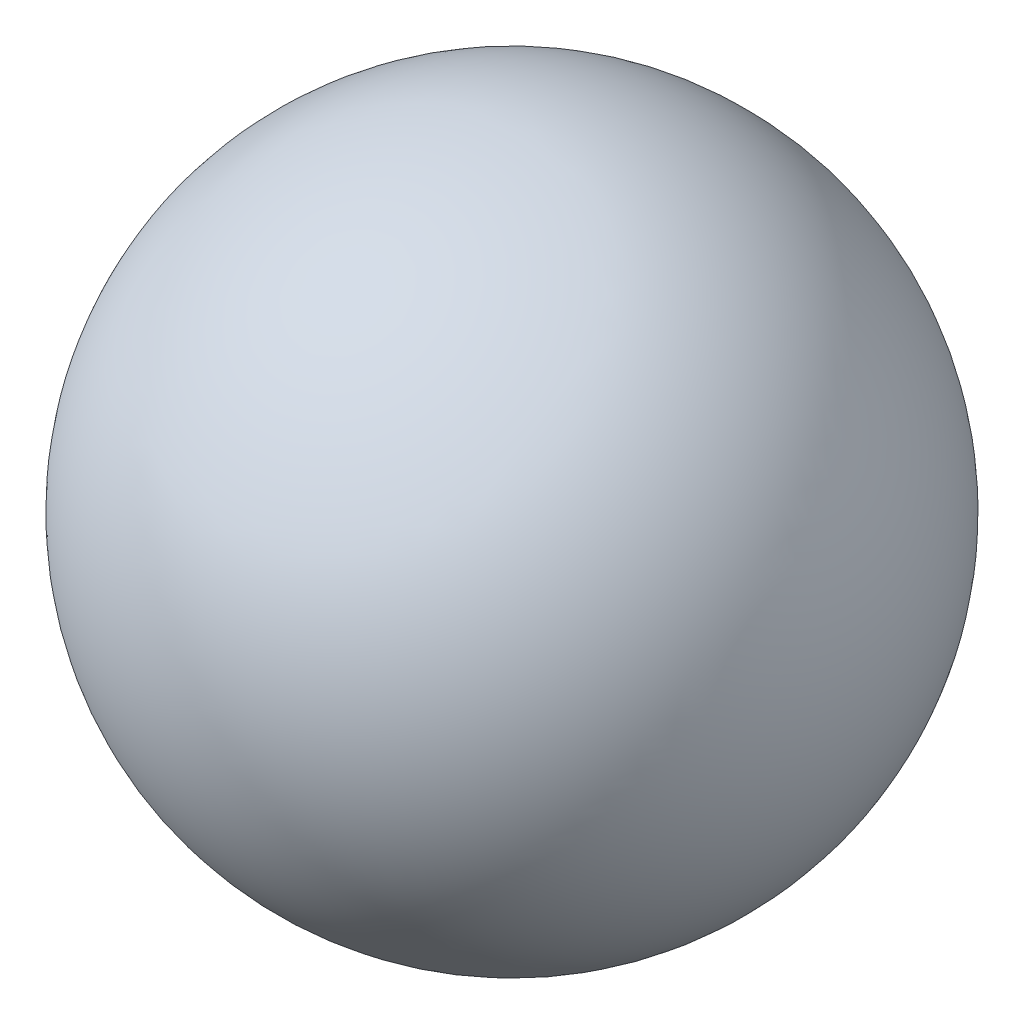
from build123d import *


with BuildPart() as part:
    # Sketch3 → Revolve1 (revolve)
    with BuildSketch(Plane.XY):
        with BuildLine():
            Line((-3.96875, 0), (3.96875, 0))
            ThreePointArc((3.96875, 0), (0, 3.96875), (-3.96875, 0))
        make_face()
    revolve(axis=Axis((-3.96875, 0, 0), (1, 0, 0)))


solid = part.part
